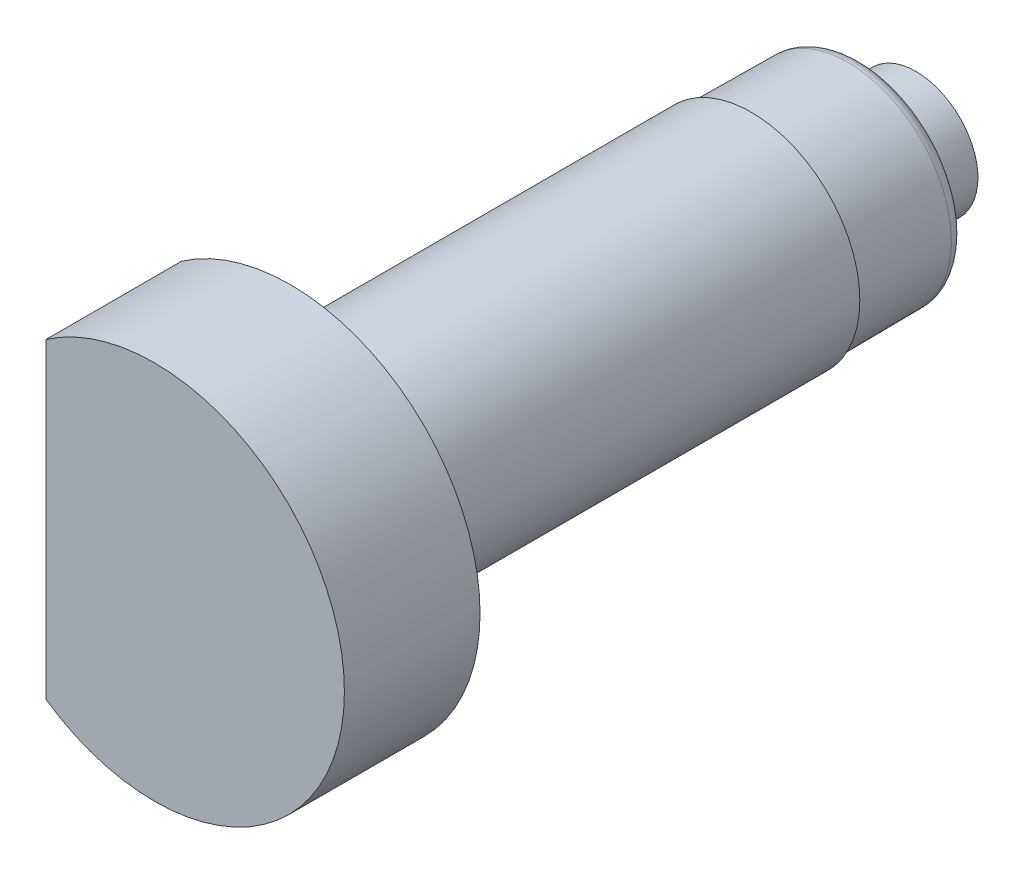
ISO-10303-21;
HEADER;
FILE_DESCRIPTION(('STEP AP214'),'2;1');
FILE_NAME('part.step','',(''),(''),'','','');
FILE_SCHEMA(('AUTOMOTIVE_DESIGN { 1 0 10303 214 1 1 1 1 }'));
ENDSEC;
DATA;
#1=APPLICATION_CONTEXT('core data for automotive mechanical design processes');
#2=APPLICATION_PROTOCOL_DEFINITION('international standard','automotive_design',2000,#1);
#3=PRODUCT_CONTEXT('',#1,'mechanical');
#4=PRODUCT('Part','Part','',(#3));
#5=PRODUCT_RELATED_PRODUCT_CATEGORY('part','',(#4));
#6=PRODUCT_DEFINITION_FORMATION('','',#4);
#7=PRODUCT_DEFINITION_CONTEXT('part definition',#1,'design');
#8=PRODUCT_DEFINITION('design','',#6,#7);
#9=PRODUCT_DEFINITION_SHAPE('','',#8);
#10=(LENGTH_UNIT() NAMED_UNIT(*) SI_UNIT(.MILLI.,.METRE.));
#11=(NAMED_UNIT(*) PLANE_ANGLE_UNIT() SI_UNIT($,.RADIAN.));
#12=(NAMED_UNIT(*) SI_UNIT($,.STERADIAN.) SOLID_ANGLE_UNIT());
#13=UNCERTAINTY_MEASURE_WITH_UNIT(LENGTH_MEASURE(1.E-05),#10,'distance_accuracy_value','');
#14=(GEOMETRIC_REPRESENTATION_CONTEXT(3) GLOBAL_UNCERTAINTY_ASSIGNED_CONTEXT((#13)) GLOBAL_UNIT_ASSIGNED_CONTEXT((#10,
#11,#12)) REPRESENTATION_CONTEXT('',''));
#15=CARTESIAN_POINT('',(0.,0.,0.));
#16=DIRECTION('',(0.,0.,1.));
#17=DIRECTION('',(1.,0.,0.));
#18=AXIS2_PLACEMENT_3D('',#15,#16,#17);
#19=CARTESIAN_POINT('',(27.668226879,0.,123.91));
#20=DIRECTION('',(0.,-0.00872653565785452,-0.99996192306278));
#21=DIRECTION('',(0.,-0.99996192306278,0.00872653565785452));
#22=AXIS2_PLACEMENT_3D('',#19,#20,#21);
#23=PLANE('',#22);
#24=DIRECTION('',(-1.,0.,0.));
#25=VECTOR('',#24,1.);
#26=CARTESIAN_POINT('',(25.375,0.,123.91));
#27=LINE('',#26,#25);
#28=CARTESIAN_POINT('',(27.6410344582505,4.64771387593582E-10,123.909999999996));
#29=VERTEX_POINT('',#28);
#30=CARTESIAN_POINT('',(23.1089655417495,2.03475407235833E-10,123.910000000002));
#31=VERTEX_POINT('',#30);
#32=EDGE_CURVE('E93',#29,#31,#27,.T.);
#33=ORIENTED_EDGE('',*,*,#32,.F.);
#34=CARTESIAN_POINT('',(25.375,-0.000172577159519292,123.910001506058));
#35=DIRECTION('',(0.,-0.00872653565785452,-0.99996192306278));
#36=DIRECTION('',(0.,-0.99996192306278,0.00872653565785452));
#37=AXIS2_PLACEMENT_3D('',#34,#35,#36);
#38=ELLIPSE('',#37,2.26612075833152,2.26603446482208);
#39=EDGE_CURVE('E87',#29,#31,#38,.T.);
#40=ORIENTED_EDGE('',*,*,#39,.T.);
#41=EDGE_LOOP('',(#33,#40));
#42=FACE_BOUND('',#41,.T.);
#43=ADVANCED_FACE('F30',(#42),#23,.T.);
#44=CARTESIAN_POINT('',(27.668226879,2.279804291,123.929895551));
#45=DIRECTION('',(0.,0.00872653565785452,-0.99996192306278));
#46=DIRECTION('',(0.,-0.99996192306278,-0.00872653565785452));
#47=AXIS2_PLACEMENT_3D('',#44,#45,#46);
#48=PLANE('',#47);
#49=ORIENTED_EDGE('',*,*,#32,.T.);
#50=CARTESIAN_POINT('',(25.375,0.000172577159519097,123.910001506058));
#51=DIRECTION('',(0.,0.00872653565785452,-0.99996192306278));
#52=DIRECTION('',(0.,0.99996192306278,0.00872653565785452));
#53=AXIS2_PLACEMENT_3D('',#50,#51,#52);
#54=ELLIPSE('',#53,2.26612075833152,2.26603446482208);
#55=EDGE_CURVE('E95',#31,#29,#54,.T.);
#56=ORIENTED_EDGE('',*,*,#55,.T.);
#57=EDGE_LOOP('',(#49,#56));
#58=FACE_BOUND('',#57,.T.);
#59=ADVANCED_FACE('F94',(#58),#48,.T.);
#60=CARTESIAN_POINT('',(25.375,0.,123.89782));
#61=DIRECTION('',(0.,0.,1.));
#62=DIRECTION('',(0.,-1.,0.));
#63=AXIS2_PLACEMENT_3D('',#60,#61,#62);
#64=CONICAL_SURFACE('',#63,2.265928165,0.0087266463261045);
#65=CARTESIAN_POINT('',(25.375,0.,125.444363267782));
#66=DIRECTION('',(0.,0.,1.));
#67=DIRECTION('',(0.,-1.,0.));
#68=AXIS2_PLACEMENT_3D('',#65,#66,#67);
#69=CIRCLE('',#68,2.27942464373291);
#70=CARTESIAN_POINT('',(25.375,-2.27942464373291,125.444363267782));
#71=VERTEX_POINT('',#70);
#72=EDGE_CURVE('E143',#71,#71,#69,.F.);
#73=ORIENTED_EDGE('',*,*,#72,.T.);
#74=EDGE_LOOP('',(#73));
#75=FACE_BOUND('',#74,.T.);
#76=ORIENTED_EDGE('',*,*,#55,.F.);
#77=ORIENTED_EDGE('',*,*,#39,.F.);
#78=EDGE_LOOP('',(#76,#77));
#79=FACE_BOUND('',#78,.T.);
#80=ADVANCED_FACE('F99',(#75,#79),#64,.T.);
#81=CARTESIAN_POINT('',(21.523075,3.851925,125.94));
#82=DIRECTION('',(0.,0.,1.));
#83=DIRECTION('',(0.,-1.,0.));
#84=AXIS2_PLACEMENT_3D('',#81,#82,#83);
#85=PLANE('',#84);
#86=CARTESIAN_POINT('',(25.375,0.,125.94));
#87=DIRECTION('',(0.,0.,1.));
#88=DIRECTION('',(1.,0.,0.));
#89=AXIS2_PLACEMENT_3D('',#86,#87,#88);
#90=CIRCLE('',#89,2.77940560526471);
#91=CARTESIAN_POINT('',(28.1544056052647,0.,125.94));
#92=VERTEX_POINT('',#91);
#93=EDGE_CURVE('E39',#92,#92,#90,.T.);
#94=ORIENTED_EDGE('',*,*,#93,.T.);
#95=EDGE_LOOP('',(#94));
#96=FACE_BOUND('',#95,.T.);
#97=CARTESIAN_POINT('',(25.375,0.,125.94));
#98=DIRECTION('',(0.,0.,1.));
#99=DIRECTION('',(1.,0.,0.));
#100=AXIS2_PLACEMENT_3D('',#97,#98,#99);
#101=CIRCLE('',#100,3.31059439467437);
#102=CARTESIAN_POINT('',(28.6855943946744,0.,125.94));
#103=VERTEX_POINT('',#102);
#104=EDGE_CURVE('E151',#103,#103,#101,.F.);
#105=ORIENTED_EDGE('',*,*,#104,.T.);
#106=EDGE_LOOP('',(#105));
#107=FACE_BOUND('',#106,.T.);
#108=ADVANCED_FACE('F157',(#96,#107),#85,.F.);
#109=CARTESIAN_POINT('',(21.375,7.084,152.));
#110=DIRECTION('',(0.,0.,-1.));
#111=DIRECTION('',(1.,0.,0.));
#112=AXIS2_PLACEMENT_3D('',#109,#110,#111);
#113=PLANE('',#112);
#114=CARTESIAN_POINT('',(25.375,0.,152.));
#115=DIRECTION('',(0.,0.,-1.));
#116=DIRECTION('',(-1.,0.,0.));
#117=AXIS2_PLACEMENT_3D('',#114,#115,#116);
#118=CIRCLE('',#117,7.);
#119=CARTESIAN_POINT('',(21.3749999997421,-5.74456264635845,152.));
#120=VERTEX_POINT('',#119);
#121=CARTESIAN_POINT('',(21.3750000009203,5.74456264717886,152.));
#122=VERTEX_POINT('',#121);
#123=EDGE_CURVE('E244',#120,#122,#118,.F.);
#124=ORIENTED_EDGE('',*,*,#123,.T.);
#125=DIRECTION('',(0.,1.,0.));
#126=VECTOR('',#125,1.);
#127=CARTESIAN_POINT('',(21.375,0.,152.));
#128=LINE('',#127,#126);
#129=EDGE_CURVE('E268',#120,#122,#128,.T.);
#130=ORIENTED_EDGE('',*,*,#129,.F.);
#131=EDGE_LOOP('',(#124,#130));
#132=FACE_BOUND('',#131,.T.);
#133=ADVANCED_FACE('F171',(#132),#113,.F.);
#134=CARTESIAN_POINT('',(25.375,0.,125.94));
#135=DIRECTION('',(0.,0.,1.));
#136=DIRECTION('',(1.,0.,0.));
#137=AXIS2_PLACEMENT_3D('',#134,#135,#136);
#138=CONICAL_SURFACE('',#137,3.80625,0.00872664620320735);
#139=CARTESIAN_POINT('',(25.375,0.,126.435636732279));
#140=DIRECTION('',(0.,0.,-1.));
#141=DIRECTION('',(-1.,0.,0.));
#142=AXIS2_PLACEMENT_3D('',#139,#140,#141);
#143=CIRCLE('',#142,3.81057535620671);
#144=CARTESIAN_POINT('',(21.5644246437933,0.,126.435636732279));
#145=VERTEX_POINT('',#144);
#146=EDGE_CURVE('E11',#145,#145,#143,.F.);
#147=ORIENTED_EDGE('',*,*,#146,.T.);
#148=EDGE_LOOP('',(#147));
#149=FACE_BOUND('',#148,.T.);
#150=CARTESIAN_POINT('',(25.375,0.,130.));
#151=DIRECTION('',(0.,0.,1.));
#152=DIRECTION('',(1.,0.,0.));
#153=AXIS2_PLACEMENT_3D('',#150,#151,#152);
#154=CIRCLE('',#153,3.841681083);
#155=CARTESIAN_POINT('',(29.216681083,0.,130.));
#156=VERTEX_POINT('',#155);
#157=EDGE_CURVE('E240',#156,#156,#154,.F.);
#158=ORIENTED_EDGE('',*,*,#157,.T.);
#159=EDGE_LOOP('',(#158));
#160=FACE_BOUND('',#159,.T.);
#161=ADVANCED_FACE('F304',(#149,#160),#138,.T.);
#162=CARTESIAN_POINT('',(21.375,2.061552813,147.));
#163=CARTESIAN_POINT('',(21.819444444,1.832491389,147.));
#164=CARTESIAN_POINT('',(21.819444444,1.832491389,146.5));
#165=CARTESIAN_POINT('',(21.375,1.978879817,147.));
#166=CARTESIAN_POINT('',(21.791537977,1.778344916,146.963467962));
#167=CARTESIAN_POINT('',(21.781569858,1.759003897,146.500000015));
#168=CARTESIAN_POINT('',(21.375,1.895466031,147.));
#169=CARTESIAN_POINT('',(21.760456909,1.715124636,146.934727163));
#170=CARTESIAN_POINT('',(21.746244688,1.684858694,146.505371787));
#171=CARTESIAN_POINT('',(21.375,1.727967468,147.));
#172=CARTESIAN_POINT('',(21.699986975,1.58161957,146.892522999));
#173=CARTESIAN_POINT('',(21.680760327,1.535971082,146.523453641));
#174=CARTESIAN_POINT('',(21.375,1.643752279,147.));
#175=CARTESIAN_POINT('',(21.670141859,1.510979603,146.877963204));
#176=CARTESIAN_POINT('',(21.650539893,1.461113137,146.53619757));
#177=CARTESIAN_POINT('',(21.375,1.474179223,147.));
#178=CARTESIAN_POINT('',(21.6140365,1.365344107,146.85934601));
#179=CARTESIAN_POINT('',(21.594873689,1.310381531,146.567112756));
#180=CARTESIAN_POINT('',(21.375,1.388823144,147.));
#181=CARTESIAN_POINT('',(21.587376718,1.289915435,146.85476302));
#182=CARTESIAN_POINT('',(21.569429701,1.234509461,146.585299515));
#183=CARTESIAN_POINT('',(21.375,1.216816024,147.));
#184=CARTESIAN_POINT('',(21.538490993,1.136021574,146.853089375));
#185=CARTESIAN_POINT('',(21.523183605,1.081614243,146.625830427));
#186=CARTESIAN_POINT('',(21.375,1.129933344,147.));
#187=CARTESIAN_POINT('',(21.515890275,1.056868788,146.855771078));
#188=CARTESIAN_POINT('',(21.502341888,1.004385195,146.648250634));
#189=CARTESIAN_POINT('',(21.375,0.869961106,147.));
#190=CARTESIAN_POINT('',(21.456748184,0.821486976,146.871482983));
#191=CARTESIAN_POINT('',(21.447266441,0.77329876,146.719544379));
#192=CARTESIAN_POINT('',(21.375,0.696885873,147.));
#193=CARTESIAN_POINT('',(21.425836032,0.658028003,146.891983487));
#194=CARTESIAN_POINT('',(21.420202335,0.61945411,146.772497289));
#195=CARTESIAN_POINT('',(21.375,0.34961627,147.));
#196=CARTESIAN_POINT('',(21.3854654,0.332069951,146.941420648));
#197=CARTESIAN_POINT('',(21.384064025,0.310770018,146.883450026));
#198=CARTESIAN_POINT('',(21.375,0.175472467,147.));
#199=CARTESIAN_POINT('',(21.375,0.165716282,146.970756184));
#200=CARTESIAN_POINT('',(21.375,0.155973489,146.941510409));
#201=CARTESIAN_POINT('',(21.375,0.,147.));
#202=CARTESIAN_POINT('',(21.375,0.,147.));
#203=CARTESIAN_POINT('',(21.375,0.,147.));
#204=(BOUNDED_SURFACE() B_SPLINE_SURFACE(3,2,((#162,#163,#164),(#165,#166,#167),(#168,#169,
#170),(#171,#172,#173),(#174,#175,#176),(#177,#178,#179),(#180,#181,#182),(#183,#184,#185),
(#186,#187,#188),(#189,#190,#191),(#192,#193,#194),(#195,#196,#197),(#198,#199,#200),(#201,#202,
#203)),.UNSPECIFIED.,.F.,.F.,.F.) B_SPLINE_SURFACE_WITH_KNOTS((4,2,2,2,2,2,4),(3,3),
(0.00114625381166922,0.00142441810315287,0.00170258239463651,0.00198074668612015,
0.00225891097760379,0.00281523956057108,0.00337156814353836),(0.,1.),
.UNSPECIFIED.) GEOMETRIC_REPRESENTATION_ITEM() RATIONAL_B_SPLINE_SURFACE(((1.,0.707106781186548,
1.),(1.,0.733881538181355,1.),(1.,0.758221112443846,1.),(1.,0.802674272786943,1.),(1.,
0.822829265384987,1.),(1.,0.859578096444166,1.),(1.,0.876166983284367,1.),(1.,0.906101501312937,
1.),(1.,0.919470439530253,1.),(1.,0.954623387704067,1.),(1.,0.971652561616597,1.),(1.,
0.994349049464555,1.),(1.,0.999980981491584,1.),(1.,1.,1.))) REPRESENTATION_ITEM('') SURFACE());
#205=DIRECTION('',(0.,-1.,0.));
#206=VECTOR('',#205,1.);
#207=CARTESIAN_POINT('',(21.375,0.,147.));
#208=LINE('',#207,#206);
#209=CARTESIAN_POINT('',(21.3750000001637,2.06155279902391,147.000000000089));
#210=VERTEX_POINT('',#209);
#211=CARTESIAN_POINT('',(21.375,-2.73470564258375E-10,146.999999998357));
#212=VERTEX_POINT('',#211);
#213=EDGE_CURVE('E186',#210,#212,#208,.T.);
#214=CARTESIAN_POINT('',(21.3749999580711,2.06155273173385,146.5));
#215=DIRECTION('',(0.458122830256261,0.888888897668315,-3.82787802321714E-08));
#216=DIRECTION('',(-0.888888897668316,0.458122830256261,0.));
#217=AXIS2_PLACEMENT_3D('',#214,#215,#216);
#218=CIRCLE('',#217,0.499999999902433);
#219=CARTESIAN_POINT('',(21.8194444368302,1.83249137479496,146.500000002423));
#220=VERTEX_POINT('',#219);
#221=EDGE_CURVE('E187',#210,#220,#218,.T.);
#222=CARTESIAN_POINT('',(21.819444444,1.832491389,146.5));
#223=CARTESIAN_POINT('',(21.781569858,1.759003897,146.500000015));
#224=CARTESIAN_POINT('',(21.746244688,1.684858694,146.505371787));
#225=CARTESIAN_POINT('',(21.680760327,1.535971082,146.523453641));
#226=CARTESIAN_POINT('',(21.650539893,1.461113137,146.53619757));
#227=CARTESIAN_POINT('',(21.594873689,1.310381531,146.567112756));
#228=CARTESIAN_POINT('',(21.569429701,1.234509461,146.585299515));
#229=CARTESIAN_POINT('',(21.523183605,1.081614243,146.625830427));
#230=CARTESIAN_POINT('',(21.502341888,1.004385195,146.648250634));
#231=CARTESIAN_POINT('',(21.447266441,0.77329876,146.719544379));
#232=CARTESIAN_POINT('',(21.420202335,0.61945411,146.772497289));
#233=CARTESIAN_POINT('',(21.384064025,0.310770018,146.883450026));
#234=CARTESIAN_POINT('',(21.375,0.155973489,146.941510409));
#235=CARTESIAN_POINT('',(21.375,0.,147.));
#236=(BOUNDED_CURVE() B_SPLINE_CURVE(3,(#222,#223,#224,#225,#226,#227,#228,#229,#230,#231,#232,
#233,#234,#235),.UNSPECIFIED.,.F.,.F.) B_SPLINE_CURVE_WITH_KNOTS((4,2,2,2,2,2,4),
(0.00114625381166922,0.00142441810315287,0.00170258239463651,0.00198074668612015,
0.00225891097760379,0.00281523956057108,0.00337156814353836),
.UNSPECIFIED.) CURVE() GEOMETRIC_REPRESENTATION_ITEM() RATIONAL_B_SPLINE_CURVE((1.,1.,1.,1.,1.,
1.,1.,1.,1.,1.,1.,1.,1.,1.)) REPRESENTATION_ITEM(''));
#237=EDGE_CURVE('E334',#220,#212,#236,.T.);
#238=ORIENTED_EDGE('',*,*,#213,.F.);
#239=ORIENTED_EDGE('',*,*,#221,.T.);
#240=ORIENTED_EDGE('',*,*,#237,.T.);
#241=EDGE_LOOP('',(#238,#239,#240));
#242=FACE_BOUND('',#241,.T.);
#243=ADVANCED_FACE('F291',(#242),#204,.F.);
#244=CARTESIAN_POINT('',(21.819444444,-1.832491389,146.5));
#245=CARTESIAN_POINT('',(21.819444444,-1.832491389,147.));
#246=CARTESIAN_POINT('',(21.375,-2.061552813,147.));
#247=CARTESIAN_POINT('',(21.781569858,-1.759003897,146.500000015));
#248=CARTESIAN_POINT('',(21.791537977,-1.778344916,146.963467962));
#249=CARTESIAN_POINT('',(21.375,-1.978879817,147.));
#250=CARTESIAN_POINT('',(21.746244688,-1.684858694,146.505371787));
#251=CARTESIAN_POINT('',(21.760456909,-1.715124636,146.934727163));
#252=CARTESIAN_POINT('',(21.375,-1.895466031,147.));
#253=CARTESIAN_POINT('',(21.680760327,-1.535971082,146.523453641));
#254=CARTESIAN_POINT('',(21.699986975,-1.58161957,146.892522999));
#255=CARTESIAN_POINT('',(21.375,-1.727967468,147.));
#256=CARTESIAN_POINT('',(21.650539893,-1.461113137,146.53619757));
#257=CARTESIAN_POINT('',(21.670141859,-1.510979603,146.877963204));
#258=CARTESIAN_POINT('',(21.375,-1.643752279,147.));
#259=CARTESIAN_POINT('',(21.594873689,-1.310381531,146.567112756));
#260=CARTESIAN_POINT('',(21.6140365,-1.365344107,146.85934601));
#261=CARTESIAN_POINT('',(21.375,-1.474179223,147.));
#262=CARTESIAN_POINT('',(21.569429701,-1.234509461,146.585299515));
#263=CARTESIAN_POINT('',(21.587376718,-1.289915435,146.85476302));
#264=CARTESIAN_POINT('',(21.375,-1.388823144,147.));
#265=CARTESIAN_POINT('',(21.523183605,-1.081614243,146.625830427));
#266=CARTESIAN_POINT('',(21.538490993,-1.136021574,146.853089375));
#267=CARTESIAN_POINT('',(21.375,-1.216816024,147.));
#268=CARTESIAN_POINT('',(21.502341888,-1.004385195,146.648250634));
#269=CARTESIAN_POINT('',(21.515890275,-1.056868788,146.855771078));
#270=CARTESIAN_POINT('',(21.375,-1.129933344,147.));
#271=CARTESIAN_POINT('',(21.447266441,-0.77329876,146.719544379));
#272=CARTESIAN_POINT('',(21.456748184,-0.821486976,146.871482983));
#273=CARTESIAN_POINT('',(21.375,-0.869961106,147.));
#274=CARTESIAN_POINT('',(21.420202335,-0.61945411,146.772497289));
#275=CARTESIAN_POINT('',(21.425836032,-0.658028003,146.891983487));
#276=CARTESIAN_POINT('',(21.375,-0.696885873,147.));
#277=CARTESIAN_POINT('',(21.384064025,-0.310770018,146.883450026));
#278=CARTESIAN_POINT('',(21.3854654,-0.332069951,146.941420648));
#279=CARTESIAN_POINT('',(21.375,-0.34961627,147.));
#280=CARTESIAN_POINT('',(21.375,-0.155973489,146.941510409));
#281=CARTESIAN_POINT('',(21.375,-0.165716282,146.970756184));
#282=CARTESIAN_POINT('',(21.375,-0.175472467,147.));
#283=CARTESIAN_POINT('',(21.375,0.,147.));
#284=CARTESIAN_POINT('',(21.375,0.,147.));
#285=CARTESIAN_POINT('',(21.375,0.,147.));
#286=(BOUNDED_SURFACE() B_SPLINE_SURFACE(3,2,((#244,#245,#246),(#247,#248,#249),(#250,#251,
#252),(#253,#254,#255),(#256,#257,#258),(#259,#260,#261),(#262,#263,#264),(#265,#266,#267),
(#268,#269,#270),(#271,#272,#273),(#274,#275,#276),(#277,#278,#279),(#280,#281,#282),(#283,#284,
#285)),.UNSPECIFIED.,.F.,.F.,.F.) B_SPLINE_SURFACE_WITH_KNOTS((4,2,2,2,2,2,4),(3,3),
(0.00114625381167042,0.0014244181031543,0.00170258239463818,0.00198074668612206,
0.00225891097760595,0.00281523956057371,0.00337156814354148),(0.,1.),
.UNSPECIFIED.) GEOMETRIC_REPRESENTATION_ITEM() RATIONAL_B_SPLINE_SURFACE(((1.,0.707106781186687,
1.),(1.,0.733881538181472,1.),(1.,0.758221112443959,1.),(1.,0.802674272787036,1.),(1.,
0.822829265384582,1.),(1.,0.859578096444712,1.),(1.,0.876166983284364,1.),(1.,0.906101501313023,
1.),(1.,0.919470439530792,1.),(1.,0.954623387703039,1.),(1.,0.971652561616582,1.),(1.,
0.994349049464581,1.),(1.,0.999980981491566,1.),(1.,1.,1.))) REPRESENTATION_ITEM('') SURFACE());
#287=CARTESIAN_POINT('',(21.375,0.,147.));
#288=CARTESIAN_POINT('',(21.3749983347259,-0.0518711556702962,146.980549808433));
#289=CARTESIAN_POINT('',(21.3760024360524,-0.103742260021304,146.96109594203));
#290=CARTESIAN_POINT('',(21.3800282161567,-0.207276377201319,146.922444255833));
#291=CARTESIAN_POINT('',(21.3830422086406,-0.258939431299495,146.903245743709));
#292=CARTESIAN_POINT('',(21.391083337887,-0.362112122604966,146.865265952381));
#293=CARTESIAN_POINT('',(21.3961053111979,-0.413621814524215,146.846483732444));
#294=CARTESIAN_POINT('',(21.4081531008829,-0.516534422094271,146.809487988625));
#295=CARTESIAN_POINT('',(21.4151762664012,-0.567937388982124,146.791273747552));
#296=CARTESIAN_POINT('',(21.4312730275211,-0.67068710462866,146.755619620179));
#297=CARTESIAN_POINT('',(21.4403464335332,-0.722033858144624,146.738179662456));
#298=CARTESIAN_POINT('',(21.4605870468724,-0.824724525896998,146.704286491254));
#299=CARTESIAN_POINT('',(21.4717571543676,-0.87606833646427,146.687834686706));
#300=CARTESIAN_POINT('',(21.4962379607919,-0.978763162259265,146.656159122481));
#301=CARTESIAN_POINT('',(21.5095535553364,-1.03011391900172,146.640938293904));
#302=CARTESIAN_POINT('',(21.5382899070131,-1.13245410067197,146.612158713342));
#303=CARTESIAN_POINT('',(21.5537017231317,-1.18344414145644,146.598593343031));
#304=CARTESIAN_POINT('',(21.578421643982,-1.25964629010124,146.579755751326));
#305=CARTESIAN_POINT('',(21.5869081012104,-1.28494414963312,146.573739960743));
#306=CARTESIAN_POINT('',(21.6044086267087,-1.33542336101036,146.562268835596));
#307=CARTESIAN_POINT('',(21.6134215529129,-1.36060484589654,146.556812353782));
#308=CARTESIAN_POINT('',(21.631979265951,-1.41085526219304,146.546505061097));
#309=CARTESIAN_POINT('',(21.6415233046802,-1.43592430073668,146.541653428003));
#310=CARTESIAN_POINT('',(21.6611528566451,-1.48595725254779,146.532626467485));
#311=CARTESIAN_POINT('',(21.6712380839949,-1.51092121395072,146.528450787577));
#312=CARTESIAN_POINT('',(21.6919593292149,-1.5607512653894,146.520849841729));
#313=CARTESIAN_POINT('',(21.7025956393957,-1.58561729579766,146.517424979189));
#314=CARTESIAN_POINT('',(21.7244325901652,-1.6352652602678,146.5113940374));
#315=CARTESIAN_POINT('',(21.7356343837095,-1.66004690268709,146.508789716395));
#316=CARTESIAN_POINT('',(21.7586094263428,-1.70952002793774,146.50451958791));
#317=CARTESIAN_POINT('',(21.7703843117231,-1.7342110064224,146.502856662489));
#318=CARTESIAN_POINT('',(21.7945012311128,-1.78347423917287,146.500594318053));
#319=CARTESIAN_POINT('',(21.806845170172,-1.80804573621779,146.499998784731));
#320=CARTESIAN_POINT('',(21.819444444,-1.832491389,146.5));
#321=B_SPLINE_CURVE_WITH_KNOTS('',3,(#287,#288,#289,#290,#291,#292,#293,#294,#295,#296,#297,
#298,#299,#300,#301,#302,#303,#304,#305,#306,#307,#308,#309,#310,#311,#312,#313,#314,#315,#316,
#317,#318,#319,#320),.UNSPECIFIED.,.F.,.F.,(4,2,2,2,2,2,2,2,2,2,2,2,2,2,2,2,4),(0.,
0.166186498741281,0.331741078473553,0.49687265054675,0.661786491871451,0.826685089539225,
0.991813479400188,1.15732414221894,1.32214978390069,1.40420004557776,1.48607848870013,
1.56784438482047,1.64956750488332,1.73133442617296,1.81327538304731,1.89546586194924,
1.97795494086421),.UNSPECIFIED.);
#322=CARTESIAN_POINT('',(21.8194444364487,-1.83249137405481,146.500000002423));
#323=VERTEX_POINT('',#322);
#324=EDGE_CURVE('E114',#212,#323,#321,.T.);
#325=CARTESIAN_POINT('',(21.374999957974,-2.0615527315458,146.5));
#326=DIRECTION('',(0.458122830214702,-0.888888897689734,-3.8367355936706E-08));
#327=DIRECTION('',(0.888888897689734,0.458122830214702,0.));
#328=AXIS2_PLACEMENT_3D('',#325,#326,#327);
#329=CIRCLE('',#328,0.499999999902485);
#330=CARTESIAN_POINT('',(21.3750000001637,-2.06155279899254,147.000000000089));
#331=VERTEX_POINT('',#330);
#332=EDGE_CURVE('E100',#323,#331,#329,.T.);
#333=DIRECTION('',(0.,-1.,0.));
#334=VECTOR('',#333,1.);
#335=CARTESIAN_POINT('',(21.375,0.,147.));
#336=LINE('',#335,#334);
#337=EDGE_CURVE('E263',#212,#331,#336,.T.);
#338=ORIENTED_EDGE('',*,*,#324,.T.);
#339=ORIENTED_EDGE('',*,*,#332,.T.);
#340=ORIENTED_EDGE('',*,*,#337,.F.);
#341=EDGE_LOOP('',(#338,#339,#340));
#342=FACE_BOUND('',#341,.T.);
#343=ADVANCED_FACE('F279',(#342),#286,.F.);
#344=CARTESIAN_POINT('',(25.375,-4.549916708,146.997502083));
#345=CARTESIAN_POINT('',(23.625685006,-4.549916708,146.997502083));
#346=CARTESIAN_POINT('',(22.132030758,-3.639367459,146.997502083));
#347=CARTESIAN_POINT('',(21.330629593,-2.084420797,146.997502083));
#348=CARTESIAN_POINT('',(25.375,-4.209973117,147.031610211));
#349=CARTESIAN_POINT('',(23.756383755,-4.209973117,147.031610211));
#350=CARTESIAN_POINT('',(22.374326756,-3.367454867,147.031610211));
#351=CARTESIAN_POINT('',(21.632801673,-1.928684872,147.031610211));
#352=CARTESIAN_POINT('',(25.375,-3.968389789,146.790026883));
#353=CARTESIAN_POINT('',(23.849265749,-3.968389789,146.790026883));
#354=CARTESIAN_POINT('',(22.546516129,-3.174218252,146.790026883));
#355=CARTESIAN_POINT('',(21.84754241,-1.818010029,146.790026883));
#356=CARTESIAN_POINT('',(25.375,-4.002497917,146.450083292));
#357=CARTESIAN_POINT('',(23.836152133,-4.002497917,146.450083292));
#358=CARTESIAN_POINT('',(22.52220544,-3.201500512,146.450083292));
#359=CARTESIAN_POINT('',(21.817224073,-1.833635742,146.450083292));
#360=(BOUNDED_SURFACE() B_SPLINE_SURFACE(3,3,((#344,#345,#346,#347),(#348,#349,#350,#351),(#352,
#353,#354,#355),(#356,#357,#358,#359)),.UNSPECIFIED.,.F.,.F.,
.F.) B_SPLINE_SURFACE_WITH_KNOTS((4,4),(4,4),(0.,1.),(0.,1.),
.UNSPECIFIED.) GEOMETRIC_REPRESENTATION_ITEM() RATIONAL_B_SPLINE_SURFACE(((1.,0.902567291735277,
0.902567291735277,1.),(0.755320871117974,0.68172791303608,0.68172791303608,0.755320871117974),
(0.755320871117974,0.68172791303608,0.68172791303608,0.755320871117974),(1.,0.902567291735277,
0.902567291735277,1.))) REPRESENTATION_ITEM('') SURFACE());
#361=CARTESIAN_POINT('',(25.375,-4.549916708,146.997502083));
#362=CARTESIAN_POINT('',(25.375,-4.209973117,147.031610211));
#363=CARTESIAN_POINT('',(25.375,-3.968389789,146.790026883));
#364=CARTESIAN_POINT('',(25.375,-4.002497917,146.450083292));
#365=(BOUNDED_CURVE() B_SPLINE_CURVE(3,(#361,#362,#363,#364),.UNSPECIFIED.,.F.,
.F.) B_SPLINE_CURVE_WITH_KNOTS((4,4),(0.,1.),
.UNSPECIFIED.) CURVE() GEOMETRIC_REPRESENTATION_ITEM() RATIONAL_B_SPLINE_CURVE((1.,
0.755320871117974,0.755320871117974,1.)) REPRESENTATION_ITEM(''));
#366=CARTESIAN_POINT('',(25.3749999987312,-4.49999999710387,147.00000000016));
#367=VERTEX_POINT('',#366);
#368=CARTESIAN_POINT('',(25.3750000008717,-3.9999999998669,146.50000000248));
#369=VERTEX_POINT('',#368);
#370=EDGE_CURVE('E103',#367,#369,#365,.T.);
#371=CARTESIAN_POINT('',(25.375,-4.49999999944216,147.000000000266));
#372=CARTESIAN_POINT('',(23.6448765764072,-4.49999999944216,147.000000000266));
#373=CARTESIAN_POINT('',(22.1676090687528,-3.59944030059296,147.000000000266));
#374=CARTESIAN_POINT('',(21.375000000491,-2.06155281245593,147.000000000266));
#375=(BOUNDED_CURVE() B_SPLINE_CURVE(3,(#371,#372,#373,#374),.UNSPECIFIED.,.F.,
.F.) B_SPLINE_CURVE_WITH_KNOTS((4,4),(0.,1.),
.UNSPECIFIED.) CURVE() GEOMETRIC_REPRESENTATION_ITEM() RATIONAL_B_SPLINE_CURVE((0.956578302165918,
0.863376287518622,0.863376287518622,0.956578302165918)) REPRESENTATION_ITEM(''));
#376=EDGE_CURVE('E198',#331,#367,#375,.F.);
#377=CARTESIAN_POINT('',(25.375,0.,146.500000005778));
#378=DIRECTION('',(0.,0.,1.));
#379=DIRECTION('',(0.,1.,0.));
#380=AXIS2_PLACEMENT_3D('',#377,#378,#379);
#381=CIRCLE('',#380,4.);
#382=EDGE_CURVE('E277',#323,#369,#381,.T.);
#383=ORIENTED_EDGE('',*,*,#370,.F.);
#384=ORIENTED_EDGE('',*,*,#376,.F.);
#385=ORIENTED_EDGE('',*,*,#332,.F.);
#386=ORIENTED_EDGE('',*,*,#382,.T.);
#387=EDGE_LOOP('',(#383,#384,#385,#386));
#388=FACE_BOUND('',#387,.T.);
#389=ADVANCED_FACE('F290',(#388),#360,.F.);
#390=CARTESIAN_POINT('',(21.330629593,2.084420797,146.997502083));
#391=CARTESIAN_POINT('',(22.132030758,3.639367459,146.997502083));
#392=CARTESIAN_POINT('',(23.625685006,4.549916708,146.997502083));
#393=CARTESIAN_POINT('',(25.375,4.549916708,146.997502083));
#394=CARTESIAN_POINT('',(21.632801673,1.928684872,147.031610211));
#395=CARTESIAN_POINT('',(22.374326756,3.367454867,147.031610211));
#396=CARTESIAN_POINT('',(23.756383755,4.209973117,147.031610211));
#397=CARTESIAN_POINT('',(25.375,4.209973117,147.031610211));
#398=CARTESIAN_POINT('',(21.84754241,1.818010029,146.790026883));
#399=CARTESIAN_POINT('',(22.546516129,3.174218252,146.790026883));
#400=CARTESIAN_POINT('',(23.849265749,3.968389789,146.790026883));
#401=CARTESIAN_POINT('',(25.375,3.968389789,146.790026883));
#402=CARTESIAN_POINT('',(21.817224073,1.833635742,146.450083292));
#403=CARTESIAN_POINT('',(22.52220544,3.201500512,146.450083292));
#404=CARTESIAN_POINT('',(23.836152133,4.002497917,146.450083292));
#405=CARTESIAN_POINT('',(25.375,4.002497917,146.450083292));
#406=(BOUNDED_SURFACE() B_SPLINE_SURFACE(3,3,((#390,#391,#392,#393),(#394,#395,#396,#397),(#398,
#399,#400,#401),(#402,#403,#404,#405)),.UNSPECIFIED.,.F.,.F.,
.F.) B_SPLINE_SURFACE_WITH_KNOTS((4,4),(4,4),(0.,1.),(0.,1.),
.UNSPECIFIED.) GEOMETRIC_REPRESENTATION_ITEM() RATIONAL_B_SPLINE_SURFACE(((1.,0.902567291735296,
0.902567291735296,1.),(0.755320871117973,0.681727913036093,0.681727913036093,0.755320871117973),
(0.755320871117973,0.681727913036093,0.681727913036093,0.755320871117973),(1.,0.902567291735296,
0.902567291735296,1.))) REPRESENTATION_ITEM('') SURFACE());
#407=CARTESIAN_POINT('',(25.375,0.,146.500000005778));
#408=DIRECTION('',(0.,0.,1.));
#409=DIRECTION('',(0.,1.,0.));
#410=AXIS2_PLACEMENT_3D('',#407,#408,#409);
#411=CIRCLE('',#410,4.);
#412=CARTESIAN_POINT('',(25.3750000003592,3.9999999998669,146.500000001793));
#413=VERTEX_POINT('',#412);
#414=EDGE_CURVE('E243',#413,#220,#411,.T.);
#415=CARTESIAN_POINT('',(21.375000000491,2.06155281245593,147.000000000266));
#416=CARTESIAN_POINT('',(22.1676090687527,3.59944030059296,147.000000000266));
#417=CARTESIAN_POINT('',(23.6448765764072,4.49999999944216,147.000000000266));
#418=CARTESIAN_POINT('',(25.375,4.49999999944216,147.000000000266));
#419=(BOUNDED_CURVE() B_SPLINE_CURVE(3,(#415,#416,#417,#418),.UNSPECIFIED.,.F.,
.F.) B_SPLINE_CURVE_WITH_KNOTS((4,4),(0.,1.),
.UNSPECIFIED.) CURVE() GEOMETRIC_REPRESENTATION_ITEM() RATIONAL_B_SPLINE_CURVE((0.956578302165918,
0.86337628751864,0.86337628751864,0.956578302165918)) REPRESENTATION_ITEM(''));
#420=CARTESIAN_POINT('',(25.3749999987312,4.49999999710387,147.00000000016));
#421=VERTEX_POINT('',#420);
#422=EDGE_CURVE('E190',#421,#210,#419,.F.);
#423=CARTESIAN_POINT('',(25.375,4.549916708,146.997502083));
#424=CARTESIAN_POINT('',(25.375,4.209973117,147.031610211));
#425=CARTESIAN_POINT('',(25.375,3.968389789,146.790026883));
#426=CARTESIAN_POINT('',(25.375,4.002497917,146.450083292));
#427=(BOUNDED_CURVE() B_SPLINE_CURVE(3,(#423,#424,#425,#426),.UNSPECIFIED.,.F.,
.F.) B_SPLINE_CURVE_WITH_KNOTS((4,4),(0.,1.),
.UNSPECIFIED.) CURVE() GEOMETRIC_REPRESENTATION_ITEM() RATIONAL_B_SPLINE_CURVE((1.,
0.755320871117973,0.755320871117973,1.)) REPRESENTATION_ITEM(''));
#428=EDGE_CURVE('E47',#413,#421,#427,.F.);
#429=ORIENTED_EDGE('',*,*,#414,.T.);
#430=ORIENTED_EDGE('',*,*,#221,.F.);
#431=ORIENTED_EDGE('',*,*,#422,.F.);
#432=ORIENTED_EDGE('',*,*,#428,.F.);
#433=EDGE_LOOP('',(#429,#430,#431,#432));
#434=FACE_BOUND('',#433,.T.);
#435=ADVANCED_FACE('F192',(#434),#406,.F.);
#436=CARTESIAN_POINT('',(21.375,5.744562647,147.));
#437=DIRECTION('',(-1.,0.,0.));
#438=DIRECTION('',(0.,-1.,0.));
#439=AXIS2_PLACEMENT_3D('',#436,#437,#438);
#440=PLANE('',#439);
#441=DIRECTION('',(0.,0.,1.));
#442=VECTOR('',#441,1.);
#443=CARTESIAN_POINT('',(21.3750000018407,5.74456264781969,149.5));
#444=LINE('',#443,#442);
#445=CARTESIAN_POINT('',(21.3750000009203,5.74456264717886,147.));
#446=VERTEX_POINT('',#445);
#447=EDGE_CURVE('E321',#122,#446,#444,.F.);
#448=ORIENTED_EDGE('',*,*,#447,.T.);
#449=DIRECTION('',(0.,1.,0.));
#450=VECTOR('',#449,1.);
#451=CARTESIAN_POINT('',(21.375,0.,147.));
#452=LINE('',#451,#450);
#453=EDGE_CURVE('E197',#210,#446,#452,.T.);
#454=ORIENTED_EDGE('',*,*,#453,.F.);
#455=ORIENTED_EDGE('',*,*,#213,.T.);
#456=ORIENTED_EDGE('',*,*,#337,.T.);
#457=DIRECTION('',(0.,1.,0.));
#458=VECTOR('',#457,1.);
#459=CARTESIAN_POINT('',(21.375,0.,147.));
#460=LINE('',#459,#458);
#461=CARTESIAN_POINT('',(21.3749999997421,-5.74456264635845,147.));
#462=VERTEX_POINT('',#461);
#463=EDGE_CURVE('E342',#462,#331,#460,.T.);
#464=ORIENTED_EDGE('',*,*,#463,.F.);
#465=DIRECTION('',(0.,0.,-1.));
#466=VECTOR('',#465,1.);
#467=CARTESIAN_POINT('',(21.3749999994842,-5.74456264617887,149.5));
#468=LINE('',#467,#466);
#469=EDGE_CURVE('E246',#462,#120,#468,.F.);
#470=ORIENTED_EDGE('',*,*,#469,.T.);
#471=ORIENTED_EDGE('',*,*,#129,.T.);
#472=EDGE_LOOP('',(#448,#454,#455,#456,#464,#470,#471));
#473=FACE_BOUND('',#472,.T.);
#474=ADVANCED_FACE('F332',(#473),#440,.T.);
#475=CARTESIAN_POINT('',(25.375,0.,152.));
#476=DIRECTION('',(0.,0.,-1.));
#477=DIRECTION('',(-1.,0.,0.));
#478=AXIS2_PLACEMENT_3D('',#475,#476,#477);
#479=CYLINDRICAL_SURFACE('',#478,7.);
#480=ORIENTED_EDGE('',*,*,#123,.F.);
#481=ORIENTED_EDGE('',*,*,#469,.F.);
#482=CARTESIAN_POINT('',(25.375,0.,147.));
#483=DIRECTION('',(0.,0.,-1.));
#484=DIRECTION('',(-1.,0.,0.));
#485=AXIS2_PLACEMENT_3D('',#482,#483,#484);
#486=CIRCLE('',#485,7.);
#487=EDGE_CURVE('E237',#446,#462,#486,.T.);
#488=ORIENTED_EDGE('',*,*,#487,.F.);
#489=ORIENTED_EDGE('',*,*,#447,.F.);
#490=EDGE_LOOP('',(#480,#481,#488,#489));
#491=FACE_BOUND('',#490,.T.);
#492=ADVANCED_FACE('F137',(#491),#479,.T.);
#493=CARTESIAN_POINT('',(29.423,4.048,130.));
#494=DIRECTION('',(0.,0.,1.));
#495=DIRECTION('',(-1.,0.,0.));
#496=AXIS2_PLACEMENT_3D('',#493,#494,#495);
#497=PLANE('',#496);
#498=ORIENTED_EDGE('',*,*,#157,.F.);
#499=EDGE_LOOP('',(#498));
#500=FACE_BOUND('',#499,.T.);
#501=CARTESIAN_POINT('',(25.375,0.,130.));
#502=DIRECTION('',(0.,0.,1.));
#503=DIRECTION('',(1.,0.,0.));
#504=AXIS2_PLACEMENT_3D('',#501,#502,#503);
#505=CIRCLE('',#504,4.);
#506=CARTESIAN_POINT('',(29.375,0.,130.));
#507=VERTEX_POINT('',#506);
#508=EDGE_CURVE('E206',#507,#507,#505,.F.);
#509=ORIENTED_EDGE('',*,*,#508,.T.);
#510=EDGE_LOOP('',(#509));
#511=FACE_BOUND('',#510,.T.);
#512=ADVANCED_FACE('F223',(#500,#511),#497,.F.);
#513=CARTESIAN_POINT('',(32.441,7.084,147.));
#514=DIRECTION('',(0.,0.,-1.));
#515=DIRECTION('',(0.,-1.,0.));
#516=AXIS2_PLACEMENT_3D('',#513,#514,#515);
#517=PLANE('',#516);
#518=ORIENTED_EDGE('',*,*,#453,.T.);
#519=ORIENTED_EDGE('',*,*,#487,.T.);
#520=ORIENTED_EDGE('',*,*,#463,.T.);
#521=ORIENTED_EDGE('',*,*,#376,.T.);
#522=CARTESIAN_POINT('',(25.375,4.49999999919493,147.000000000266));
#523=CARTESIAN_POINT('',(34.3749999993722,4.49999999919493,147.000000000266));
#524=CARTESIAN_POINT('',(34.3749999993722,-4.49999999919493,147.000000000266));
#525=CARTESIAN_POINT('',(25.375,-4.49999999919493,147.000000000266));
#526=(BOUNDED_CURVE() B_SPLINE_CURVE(3,(#522,#523,#524,#525),.UNSPECIFIED.,.F.,
.F.) B_SPLINE_CURVE_WITH_KNOTS((4,4),(0.,1.),
.UNSPECIFIED.) CURVE() GEOMETRIC_REPRESENTATION_ITEM() RATIONAL_B_SPLINE_CURVE((0.956578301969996,
0.318859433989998,0.318859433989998,0.956578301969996)) REPRESENTATION_ITEM(''));
#527=EDGE_CURVE('E183',#367,#421,#526,.F.);
#528=ORIENTED_EDGE('',*,*,#527,.T.);
#529=ORIENTED_EDGE('',*,*,#422,.T.);
#530=EDGE_LOOP('',(#518,#519,#520,#521,#528,#529));
#531=FACE_BOUND('',#530,.T.);
#532=ADVANCED_FACE('F132',(#531),#517,.T.);
#533=CARTESIAN_POINT('',(25.375,0.,130.));
#534=DIRECTION('',(0.,0.,1.));
#535=DIRECTION('',(1.,0.,0.));
#536=AXIS2_PLACEMENT_3D('',#533,#534,#535);
#537=CYLINDRICAL_SURFACE('',#536,4.);
#538=ORIENTED_EDGE('',*,*,#508,.F.);
#539=EDGE_LOOP('',(#538));
#540=FACE_BOUND('',#539,.T.);
#541=ORIENTED_EDGE('',*,*,#414,.F.);
#542=CARTESIAN_POINT('',(25.375,0.,146.500000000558));
#543=DIRECTION('',(0.,0.,-1.));
#544=DIRECTION('',(-1.,0.,0.));
#545=AXIS2_PLACEMENT_3D('',#542,#543,#544);
#546=CIRCLE('',#545,3.9999999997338);
#547=EDGE_CURVE('E152',#413,#369,#546,.T.);
#548=ORIENTED_EDGE('',*,*,#547,.T.);
#549=ORIENTED_EDGE('',*,*,#382,.F.);
#550=ORIENTED_EDGE('',*,*,#324,.F.);
#551=ORIENTED_EDGE('',*,*,#237,.F.);
#552=EDGE_LOOP('',(#541,#548,#549,#550,#551));
#553=FACE_BOUND('',#552,.T.);
#554=ADVANCED_FACE('F121',(#540,#553),#537,.T.);
#555=CARTESIAN_POINT('',(25.375,4.549916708,146.997502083));
#556=CARTESIAN_POINT('',(34.474833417,4.549916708,146.997502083));
#557=CARTESIAN_POINT('',(34.474833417,-4.549916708,146.997502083));
#558=CARTESIAN_POINT('',(25.375,-4.549916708,146.997502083));
#559=CARTESIAN_POINT('',(25.375,4.209973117,147.031610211));
#560=CARTESIAN_POINT('',(33.794946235,4.209973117,147.031610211));
#561=CARTESIAN_POINT('',(33.794946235,-4.209973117,147.031610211));
#562=CARTESIAN_POINT('',(25.375,-4.209973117,147.031610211));
#563=CARTESIAN_POINT('',(25.375,3.968389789,146.790026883));
#564=CARTESIAN_POINT('',(33.311779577,3.968389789,146.790026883));
#565=CARTESIAN_POINT('',(33.311779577,-3.968389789,146.790026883));
#566=CARTESIAN_POINT('',(25.375,-3.968389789,146.790026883));
#567=CARTESIAN_POINT('',(25.375,4.002497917,146.450083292));
#568=CARTESIAN_POINT('',(33.379995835,4.002497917,146.450083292));
#569=CARTESIAN_POINT('',(33.379995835,-4.002497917,146.450083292));
#570=CARTESIAN_POINT('',(25.375,-4.002497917,146.450083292));
#571=(BOUNDED_SURFACE() B_SPLINE_SURFACE(3,3,((#555,#556,#557,#558),(#559,#560,#561,#562),(#563,
#564,#565,#566),(#567,#568,#569,#570)),.UNSPECIFIED.,.F.,.F.,
.F.) B_SPLINE_SURFACE_WITH_KNOTS((4,4),(4,4),(0.,1.),(0.,1.),
.UNSPECIFIED.) GEOMETRIC_REPRESENTATION_ITEM() RATIONAL_B_SPLINE_SURFACE(((1.,0.333333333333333,
0.333333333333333,1.),(0.755320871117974,0.251773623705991,0.251773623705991,0.755320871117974),
(0.755320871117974,0.251773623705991,0.251773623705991,0.755320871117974),(1.,0.333333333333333,
0.333333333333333,1.))) REPRESENTATION_ITEM('') SURFACE());
#572=ORIENTED_EDGE('',*,*,#428,.T.);
#573=ORIENTED_EDGE('',*,*,#527,.F.);
#574=ORIENTED_EDGE('',*,*,#370,.T.);
#575=ORIENTED_EDGE('',*,*,#547,.F.);
#576=EDGE_LOOP('',(#572,#573,#574,#575));
#577=FACE_BOUND('',#576,.T.);
#578=ADVANCED_FACE('F131',(#577),#571,.F.);
#579=CARTESIAN_POINT('',(25.375,0.,125.44));
#580=DIRECTION('',(0.,0.,1.));
#581=DIRECTION('',(1.,0.,0.));
#582=AXIS2_PLACEMENT_3D('',#579,#580,#581);
#583=TOROIDAL_SURFACE('',#582,2.77940560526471,0.5);
#584=ORIENTED_EDGE('',*,*,#93,.F.);
#585=EDGE_LOOP('',(#584));
#586=FACE_BOUND('',#585,.T.);
#587=ORIENTED_EDGE('',*,*,#72,.F.);
#588=EDGE_LOOP('',(#587));
#589=FACE_BOUND('',#588,.T.);
#590=ADVANCED_FACE('F160',(#586,#589),#583,.F.);
#591=CARTESIAN_POINT('',(25.375,0.,126.44));
#592=DIRECTION('',(0.,0.,1.));
#593=DIRECTION('',(1.,0.,0.));
#594=AXIS2_PLACEMENT_3D('',#591,#592,#593);
#595=TOROIDAL_SURFACE('',#594,3.31059439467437,0.5);
#596=ORIENTED_EDGE('',*,*,#146,.F.);
#597=EDGE_LOOP('',(#596));
#598=FACE_BOUND('',#597,.T.);
#599=ORIENTED_EDGE('',*,*,#104,.F.);
#600=EDGE_LOOP('',(#599));
#601=FACE_BOUND('',#600,.T.);
#602=ADVANCED_FACE('F32',(#598,#601),#595,.T.);
#603=CLOSED_SHELL('',(#43,#59,#80,#108,#133,#161,#243,#343,#389,#435,#474,#492,#512,#532,#554,
#578,#590,#602));
#604=MANIFOLD_SOLID_BREP('B2',#603);
#605=ADVANCED_BREP_SHAPE_REPRESENTATION('',(#18,#604),#14);
#606=SHAPE_DEFINITION_REPRESENTATION(#9,#605);
ENDSEC;
END-ISO-10303-21;
